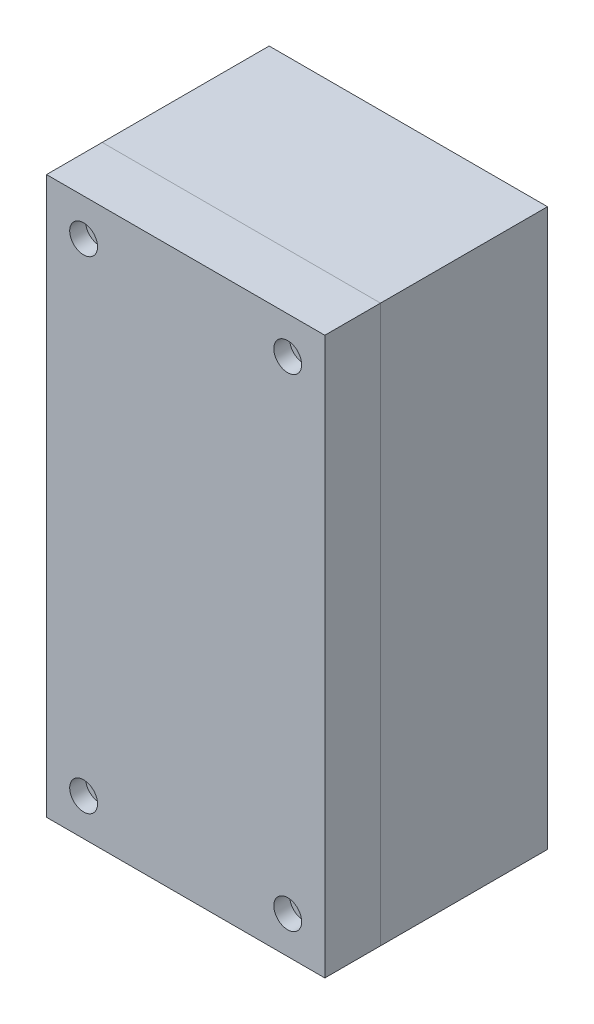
ISO-10303-21;
HEADER;
FILE_DESCRIPTION(('STEP AP214'),'2;1');
FILE_NAME('part.step','',(''),(''),'','','');
FILE_SCHEMA(('AUTOMOTIVE_DESIGN { 1 0 10303 214 1 1 1 1 }'));
ENDSEC;
DATA;
#1=APPLICATION_CONTEXT('core data for automotive mechanical design processes');
#2=APPLICATION_PROTOCOL_DEFINITION('international standard','automotive_design',2000,#1);
#3=PRODUCT_CONTEXT('',#1,'mechanical');
#4=PRODUCT('Part','Part','',(#3));
#5=PRODUCT_RELATED_PRODUCT_CATEGORY('part','',(#4));
#6=PRODUCT_DEFINITION_FORMATION('','',#4);
#7=PRODUCT_DEFINITION_CONTEXT('part definition',#1,'design');
#8=PRODUCT_DEFINITION('design','',#6,#7);
#9=PRODUCT_DEFINITION_SHAPE('','',#8);
#10=(LENGTH_UNIT() NAMED_UNIT(*) SI_UNIT(.MILLI.,.METRE.));
#11=(NAMED_UNIT(*) PLANE_ANGLE_UNIT() SI_UNIT($,.RADIAN.));
#12=(NAMED_UNIT(*) SI_UNIT($,.STERADIAN.) SOLID_ANGLE_UNIT());
#13=UNCERTAINTY_MEASURE_WITH_UNIT(LENGTH_MEASURE(1.E-05),#10,'distance_accuracy_value','');
#14=(GEOMETRIC_REPRESENTATION_CONTEXT(3) GLOBAL_UNCERTAINTY_ASSIGNED_CONTEXT((#13)) GLOBAL_UNIT_ASSIGNED_CONTEXT((#10,
#11,#12)) REPRESENTATION_CONTEXT('',''));
#15=CARTESIAN_POINT('',(0.,0.,0.));
#16=DIRECTION('',(0.,0.,1.));
#17=DIRECTION('',(1.,0.,0.));
#18=AXIS2_PLACEMENT_3D('',#15,#16,#17);
#19=CARTESIAN_POINT('',(-71.0000000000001,146.,110.));
#20=DIRECTION('',(-1.,0.,0.));
#21=DIRECTION('',(0.,-1.,0.));
#22=AXIS2_PLACEMENT_3D('',#19,#20,#21);
#23=PLANE('',#22);
#24=DIRECTION('',(0.,0.,-1.));
#25=VECTOR('',#24,1.);
#26=CARTESIAN_POINT('',(-71.0000000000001,-146.,110.));
#27=LINE('',#26,#25);
#28=CARTESIAN_POINT('',(-71.0000000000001,-146.,90.));
#29=VERTEX_POINT('',#28);
#30=CARTESIAN_POINT('',(-71.0000000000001,-146.,0.));
#31=VERTEX_POINT('',#30);
#32=EDGE_CURVE('P0_E102',#29,#31,#27,.T.);
#33=ORIENTED_EDGE('',*,*,#32,.T.);
#34=DIRECTION('',(0.,1.,0.));
#35=VECTOR('',#34,1.);
#36=CARTESIAN_POINT('',(-71.0000000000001,-150.,0.));
#37=LINE('',#36,#35);
#38=CARTESIAN_POINT('',(-71.0000000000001,146.,0.));
#39=VERTEX_POINT('',#38);
#40=EDGE_CURVE('P0_E116',#31,#39,#37,.T.);
#41=ORIENTED_EDGE('',*,*,#40,.T.);
#42=DIRECTION('',(0.,0.,1.));
#43=VECTOR('',#42,1.);
#44=CARTESIAN_POINT('',(-71.0000000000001,146.,110.));
#45=LINE('',#44,#43);
#46=CARTESIAN_POINT('',(-71.0000000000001,146.,90.));
#47=VERTEX_POINT('',#46);
#48=EDGE_CURVE('P0_E19',#39,#47,#45,.T.);
#49=ORIENTED_EDGE('',*,*,#48,.T.);
#50=DIRECTION('',(0.,1.,0.));
#51=VECTOR('',#50,1.);
#52=CARTESIAN_POINT('',(-71.0000000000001,-150.,90.));
#53=LINE('',#52,#51);
#54=EDGE_CURVE('P0_E106',#29,#47,#53,.T.);
#55=ORIENTED_EDGE('',*,*,#54,.F.);
#56=EDGE_LOOP('',(#33,#41,#49,#55));
#57=FACE_BOUND('',#56,.T.);
#58=ADVANCED_FACE('P0_F16',(#57),#23,.F.);
#59=CARTESIAN_POINT('',(71.0000000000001,146.,110.));
#60=DIRECTION('',(0.,1.,0.));
#61=DIRECTION('',(0.,0.,1.));
#62=AXIS2_PLACEMENT_3D('',#59,#60,#61);
#63=PLANE('',#62);
#64=ORIENTED_EDGE('',*,*,#48,.F.);
#65=DIRECTION('',(1.,0.,0.));
#66=VECTOR('',#65,1.);
#67=CARTESIAN_POINT('',(-75.,146.,0.));
#68=LINE('',#67,#66);
#69=CARTESIAN_POINT('',(71.0000000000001,146.,0.));
#70=VERTEX_POINT('',#69);
#71=EDGE_CURVE('P0_E130',#39,#70,#68,.T.);
#72=ORIENTED_EDGE('',*,*,#71,.T.);
#73=DIRECTION('',(0.,0.,1.));
#74=VECTOR('',#73,1.);
#75=CARTESIAN_POINT('',(71.0000000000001,146.,110.));
#76=LINE('',#75,#74);
#77=CARTESIAN_POINT('',(71.0000000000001,146.,90.));
#78=VERTEX_POINT('',#77);
#79=EDGE_CURVE('P0_E78',#70,#78,#76,.T.);
#80=ORIENTED_EDGE('',*,*,#79,.T.);
#81=DIRECTION('',(1.,0.,0.));
#82=VECTOR('',#81,1.);
#83=CARTESIAN_POINT('',(-75.,146.,90.));
#84=LINE('',#83,#82);
#85=EDGE_CURVE('P0_E90',#47,#78,#84,.T.);
#86=ORIENTED_EDGE('',*,*,#85,.F.);
#87=EDGE_LOOP('',(#64,#72,#80,#86));
#88=FACE_BOUND('',#87,.T.);
#89=ADVANCED_FACE('P0_F118',(#88),#63,.F.);
#90=CARTESIAN_POINT('',(71.0000000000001,146.,110.));
#91=DIRECTION('',(1.,0.,0.));
#92=DIRECTION('',(0.,1.,0.));
#93=AXIS2_PLACEMENT_3D('',#90,#91,#92);
#94=PLANE('',#93);
#95=ORIENTED_EDGE('',*,*,#79,.F.);
#96=DIRECTION('',(0.,1.,0.));
#97=VECTOR('',#96,1.);
#98=CARTESIAN_POINT('',(71.0000000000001,-150.,0.));
#99=LINE('',#98,#97);
#100=CARTESIAN_POINT('',(71.0000000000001,-146.,0.));
#101=VERTEX_POINT('',#100);
#102=EDGE_CURVE('P0_E98',#70,#101,#99,.F.);
#103=ORIENTED_EDGE('',*,*,#102,.T.);
#104=DIRECTION('',(0.,0.,-1.));
#105=VECTOR('',#104,1.);
#106=CARTESIAN_POINT('',(71.,-146.,110.));
#107=LINE('',#106,#105);
#108=CARTESIAN_POINT('',(71.0000000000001,-146.,90.));
#109=VERTEX_POINT('',#108);
#110=EDGE_CURVE('P0_E95',#101,#109,#107,.F.);
#111=ORIENTED_EDGE('',*,*,#110,.T.);
#112=DIRECTION('',(0.,1.,0.));
#113=VECTOR('',#112,1.);
#114=CARTESIAN_POINT('',(71.0000000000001,-150.,90.));
#115=LINE('',#114,#113);
#116=EDGE_CURVE('P0_E84',#78,#109,#115,.F.);
#117=ORIENTED_EDGE('',*,*,#116,.F.);
#118=EDGE_LOOP('',(#95,#103,#111,#117));
#119=FACE_BOUND('',#118,.T.);
#120=ADVANCED_FACE('P0_F96',(#119),#94,.F.);
#121=CARTESIAN_POINT('',(71.,-146.,110.));
#122=DIRECTION('',(0.,-1.,0.));
#123=DIRECTION('',(0.,0.,-1.));
#124=AXIS2_PLACEMENT_3D('',#121,#122,#123);
#125=PLANE('',#124);
#126=ORIENTED_EDGE('',*,*,#110,.F.);
#127=DIRECTION('',(1.,0.,0.));
#128=VECTOR('',#127,1.);
#129=CARTESIAN_POINT('',(-75.,-146.,0.));
#130=LINE('',#129,#128);
#131=EDGE_CURVE('P0_E133',#101,#31,#130,.F.);
#132=ORIENTED_EDGE('',*,*,#131,.T.);
#133=ORIENTED_EDGE('',*,*,#32,.F.);
#134=DIRECTION('',(1.,0.,0.));
#135=VECTOR('',#134,1.);
#136=CARTESIAN_POINT('',(-75.,-146.,90.));
#137=LINE('',#136,#135);
#138=EDGE_CURVE('P0_E88',#109,#29,#137,.F.);
#139=ORIENTED_EDGE('',*,*,#138,.F.);
#140=EDGE_LOOP('',(#126,#132,#133,#139));
#141=FACE_BOUND('',#140,.T.);
#142=ADVANCED_FACE('P0_F104',(#141),#125,.F.);
#143=CARTESIAN_POINT('',(74.9999999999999,150.,90.));
#144=DIRECTION('',(-1.,0.,0.));
#145=DIRECTION('',(0.,-1.,0.));
#146=AXIS2_PLACEMENT_3D('',#143,#144,#145);
#147=PLANE('',#146);
#148=DIRECTION('',(0.,0.,-1.));
#149=VECTOR('',#148,1.);
#150=CARTESIAN_POINT('',(74.9999999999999,150.,90.));
#151=LINE('',#150,#149);
#152=CARTESIAN_POINT('',(75.,150.,0.));
#153=VERTEX_POINT('',#152);
#154=CARTESIAN_POINT('',(75.,150.,90.));
#155=VERTEX_POINT('',#154);
#156=EDGE_CURVE('P0_E92',#153,#155,#151,.F.);
#157=ORIENTED_EDGE('',*,*,#156,.T.);
#158=DIRECTION('',(0.,1.,0.));
#159=VECTOR('',#158,1.);
#160=CARTESIAN_POINT('',(75.,-150.,90.));
#161=LINE('',#160,#159);
#162=CARTESIAN_POINT('',(75.,-150.,90.));
#163=VERTEX_POINT('',#162);
#164=EDGE_CURVE('P0_E119',#163,#155,#161,.T.);
#165=ORIENTED_EDGE('',*,*,#164,.F.);
#166=DIRECTION('',(0.,0.,1.));
#167=VECTOR('',#166,1.);
#168=CARTESIAN_POINT('',(75.,-150.,90.));
#169=LINE('',#168,#167);
#170=CARTESIAN_POINT('',(75.,-150.,0.));
#171=VERTEX_POINT('',#170);
#172=EDGE_CURVE('P0_E127',#163,#171,#169,.F.);
#173=ORIENTED_EDGE('',*,*,#172,.T.);
#174=DIRECTION('',(0.,1.,0.));
#175=VECTOR('',#174,1.);
#176=CARTESIAN_POINT('',(75.,-150.,0.));
#177=LINE('',#176,#175);
#178=EDGE_CURVE('P0_E136',#171,#153,#177,.T.);
#179=ORIENTED_EDGE('',*,*,#178,.T.);
#180=EDGE_LOOP('',(#157,#165,#173,#179));
#181=FACE_BOUND('',#180,.T.);
#182=ADVANCED_FACE('P0_F177',(#181),#147,.F.);
#183=CARTESIAN_POINT('',(-75.0000000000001,150.,90.));
#184=DIRECTION('',(0.,-1.,0.));
#185=DIRECTION('',(0.,0.,-1.));
#186=AXIS2_PLACEMENT_3D('',#183,#184,#185);
#187=PLANE('',#186);
#188=DIRECTION('',(0.,0.,1.));
#189=VECTOR('',#188,1.);
#190=CARTESIAN_POINT('',(-75.0000000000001,150.,90.));
#191=LINE('',#190,#189);
#192=CARTESIAN_POINT('',(-75.0000000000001,150.,0.));
#193=VERTEX_POINT('',#192);
#194=CARTESIAN_POINT('',(-75.0000000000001,150.,90.));
#195=VERTEX_POINT('',#194);
#196=EDGE_CURVE('P0_E142',#193,#195,#191,.T.);
#197=ORIENTED_EDGE('',*,*,#196,.T.);
#198=DIRECTION('',(1.,0.,0.));
#199=VECTOR('',#198,1.);
#200=CARTESIAN_POINT('',(-75.,150.,90.));
#201=LINE('',#200,#199);
#202=EDGE_CURVE('P0_E120',#155,#195,#201,.F.);
#203=ORIENTED_EDGE('',*,*,#202,.F.);
#204=ORIENTED_EDGE('',*,*,#156,.F.);
#205=DIRECTION('',(1.,0.,0.));
#206=VECTOR('',#205,1.);
#207=CARTESIAN_POINT('',(-75.,150.,0.));
#208=LINE('',#207,#206);
#209=EDGE_CURVE('P0_E139',#153,#193,#208,.F.);
#210=ORIENTED_EDGE('',*,*,#209,.T.);
#211=EDGE_LOOP('',(#197,#203,#204,#210));
#212=FACE_BOUND('',#211,.T.);
#213=ADVANCED_FACE('P0_F159',(#212),#187,.F.);
#214=CARTESIAN_POINT('',(-75.,-150.,90.));
#215=DIRECTION('',(0.,0.,1.));
#216=DIRECTION('',(1.,0.,0.));
#217=AXIS2_PLACEMENT_3D('',#214,#215,#216);
#218=PLANE('',#217);
#219=ORIENTED_EDGE('',*,*,#164,.T.);
#220=ORIENTED_EDGE('',*,*,#202,.T.);
#221=DIRECTION('',(0.,1.,0.));
#222=VECTOR('',#221,1.);
#223=CARTESIAN_POINT('',(-75.0000000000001,150.,90.));
#224=LINE('',#223,#222);
#225=CARTESIAN_POINT('',(-75.,-150.,90.));
#226=VERTEX_POINT('',#225);
#227=EDGE_CURVE('P0_E145',#195,#226,#224,.F.);
#228=ORIENTED_EDGE('',*,*,#227,.T.);
#229=DIRECTION('',(1.,0.,0.));
#230=VECTOR('',#229,1.);
#231=CARTESIAN_POINT('',(-75.,-150.,90.));
#232=LINE('',#231,#230);
#233=EDGE_CURVE('P0_E124',#226,#163,#232,.T.);
#234=ORIENTED_EDGE('',*,*,#233,.T.);
#235=EDGE_LOOP('',(#219,#220,#228,#234));
#236=FACE_BOUND('',#235,.T.);
#237=ORIENTED_EDGE('',*,*,#54,.T.);
#238=ORIENTED_EDGE('',*,*,#85,.T.);
#239=ORIENTED_EDGE('',*,*,#116,.T.);
#240=ORIENTED_EDGE('',*,*,#138,.T.);
#241=EDGE_LOOP('',(#237,#238,#239,#240));
#242=FACE_BOUND('',#241,.T.);
#243=ADVANCED_FACE('P0_F86',(#236,#242),#218,.T.);
#244=CARTESIAN_POINT('',(-75.,-150.,90.));
#245=DIRECTION('',(0.,1.,0.));
#246=DIRECTION('',(0.,0.,1.));
#247=AXIS2_PLACEMENT_3D('',#244,#245,#246);
#248=PLANE('',#247);
#249=ORIENTED_EDGE('',*,*,#172,.F.);
#250=ORIENTED_EDGE('',*,*,#233,.F.);
#251=DIRECTION('',(0.,0.,1.));
#252=VECTOR('',#251,1.);
#253=CARTESIAN_POINT('',(-75.,-150.,90.));
#254=LINE('',#253,#252);
#255=CARTESIAN_POINT('',(-75.,-150.,0.));
#256=VERTEX_POINT('',#255);
#257=EDGE_CURVE('P0_E25',#226,#256,#254,.F.);
#258=ORIENTED_EDGE('',*,*,#257,.T.);
#259=DIRECTION('',(1.,0.,0.));
#260=VECTOR('',#259,1.);
#261=CARTESIAN_POINT('',(-75.,-150.,0.));
#262=LINE('',#261,#260);
#263=EDGE_CURVE('P0_E33',#256,#171,#262,.T.);
#264=ORIENTED_EDGE('',*,*,#263,.T.);
#265=EDGE_LOOP('',(#249,#250,#258,#264));
#266=FACE_BOUND('',#265,.T.);
#267=ADVANCED_FACE('P0_F152',(#266),#248,.F.);
#268=CARTESIAN_POINT('',(-75.,-150.,0.));
#269=DIRECTION('',(0.,0.,1.));
#270=DIRECTION('',(1.,0.,0.));
#271=AXIS2_PLACEMENT_3D('',#268,#269,#270);
#272=PLANE('',#271);
#273=ORIENTED_EDGE('',*,*,#209,.F.);
#274=ORIENTED_EDGE('',*,*,#178,.F.);
#275=ORIENTED_EDGE('',*,*,#263,.F.);
#276=DIRECTION('',(0.,1.,0.));
#277=VECTOR('',#276,1.);
#278=CARTESIAN_POINT('',(-75.0000000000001,150.,0.));
#279=LINE('',#278,#277);
#280=EDGE_CURVE('P0_E11',#256,#193,#279,.T.);
#281=ORIENTED_EDGE('',*,*,#280,.T.);
#282=EDGE_LOOP('',(#273,#274,#275,#281));
#283=FACE_BOUND('',#282,.T.);
#284=ORIENTED_EDGE('',*,*,#102,.F.);
#285=ORIENTED_EDGE('',*,*,#71,.F.);
#286=ORIENTED_EDGE('',*,*,#40,.F.);
#287=ORIENTED_EDGE('',*,*,#131,.F.);
#288=EDGE_LOOP('',(#284,#285,#286,#287));
#289=FACE_BOUND('',#288,.T.);
#290=ADVANCED_FACE('P0_F161',(#283,#289),#272,.F.);
#291=CARTESIAN_POINT('',(-75.0000000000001,150.,90.));
#292=DIRECTION('',(1.,0.,0.));
#293=DIRECTION('',(0.,1.,0.));
#294=AXIS2_PLACEMENT_3D('',#291,#292,#293);
#295=PLANE('',#294);
#296=ORIENTED_EDGE('',*,*,#257,.F.);
#297=ORIENTED_EDGE('',*,*,#227,.F.);
#298=ORIENTED_EDGE('',*,*,#196,.F.);
#299=ORIENTED_EDGE('',*,*,#280,.F.);
#300=EDGE_LOOP('',(#296,#297,#298,#299));
#301=FACE_BOUND('',#300,.T.);
#302=ADVANCED_FACE('P0_F155',(#301),#295,.F.);
#303=CLOSED_SHELL('',(#58,#89,#120,#142,#182,#213,#243,#267,#290,#302));
#304=MANIFOLD_SOLID_BREP('P0_B1',#303);
#305=CARTESIAN_POINT('',(71.,-146.,110.));
#306=DIRECTION('',(0.,0.,-1.));
#307=DIRECTION('',(-1.,0.,0.));
#308=AXIS2_PLACEMENT_3D('',#305,#306,#307);
#309=PLANE('',#308);
#310=CARTESIAN_POINT('',(55.,-130.,110.));
#311=DIRECTION('',(0.,0.,1.));
#312=DIRECTION('',(1.,0.,0.));
#313=AXIS2_PLACEMENT_3D('',#310,#311,#312);
#314=CIRCLE('',#313,4.49999999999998);
#315=CARTESIAN_POINT('',(59.5,-130.,110.));
#316=VERTEX_POINT('',#315);
#317=EDGE_CURVE('P1_E89',#316,#316,#314,.T.);
#318=ORIENTED_EDGE('',*,*,#317,.T.);
#319=EDGE_LOOP('',(#318));
#320=FACE_BOUND('',#319,.T.);
#321=CARTESIAN_POINT('',(-54.9999999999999,130.,110.));
#322=DIRECTION('',(0.,0.,1.));
#323=DIRECTION('',(1.,0.,0.));
#324=AXIS2_PLACEMENT_3D('',#321,#322,#323);
#325=CIRCLE('',#324,4.49999999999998);
#326=CARTESIAN_POINT('',(-50.4999999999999,130.,110.));
#327=VERTEX_POINT('',#326);
#328=EDGE_CURVE('P1_E152',#327,#327,#325,.T.);
#329=ORIENTED_EDGE('',*,*,#328,.T.);
#330=EDGE_LOOP('',(#329));
#331=FACE_BOUND('',#330,.T.);
#332=DIRECTION('',(0.,-1.,0.));
#333=VECTOR('',#332,1.);
#334=CARTESIAN_POINT('',(-71.0000000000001,146.,110.));
#335=LINE('',#334,#333);
#336=CARTESIAN_POINT('',(-71.0000000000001,-146.,110.));
#337=VERTEX_POINT('',#336);
#338=CARTESIAN_POINT('',(-71.0000000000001,146.,110.));
#339=VERTEX_POINT('',#338);
#340=EDGE_CURVE('P1_E81',#337,#339,#335,.F.);
#341=ORIENTED_EDGE('',*,*,#340,.T.);
#342=DIRECTION('',(1.,0.,0.));
#343=VECTOR('',#342,1.);
#344=CARTESIAN_POINT('',(71.0000000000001,146.,110.));
#345=LINE('',#344,#343);
#346=CARTESIAN_POINT('',(71.0000000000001,146.,110.));
#347=VERTEX_POINT('',#346);
#348=EDGE_CURVE('P1_E78',#339,#347,#345,.T.);
#349=ORIENTED_EDGE('',*,*,#348,.T.);
#350=DIRECTION('',(0.,1.,0.));
#351=VECTOR('',#350,1.);
#352=CARTESIAN_POINT('',(71.0000000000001,146.,110.));
#353=LINE('',#352,#351);
#354=CARTESIAN_POINT('',(71.0000000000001,-146.,110.));
#355=VERTEX_POINT('',#354);
#356=EDGE_CURVE('P1_E103',#347,#355,#353,.F.);
#357=ORIENTED_EDGE('',*,*,#356,.T.);
#358=DIRECTION('',(1.,0.,0.));
#359=VECTOR('',#358,1.);
#360=CARTESIAN_POINT('',(71.,-146.,110.));
#361=LINE('',#360,#359);
#362=EDGE_CURVE('P1_E85',#355,#337,#361,.F.);
#363=ORIENTED_EDGE('',*,*,#362,.T.);
#364=EDGE_LOOP('',(#341,#349,#357,#363));
#365=FACE_BOUND('',#364,.T.);
#366=CARTESIAN_POINT('',(55.,130.,110.));
#367=DIRECTION('',(0.,0.,1.));
#368=DIRECTION('',(1.,0.,0.));
#369=AXIS2_PLACEMENT_3D('',#366,#367,#368);
#370=CIRCLE('',#369,4.49999999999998);
#371=CARTESIAN_POINT('',(59.5,130.,110.));
#372=VERTEX_POINT('',#371);
#373=EDGE_CURVE('P1_E19',#372,#372,#370,.T.);
#374=ORIENTED_EDGE('',*,*,#373,.T.);
#375=EDGE_LOOP('',(#374));
#376=FACE_BOUND('',#375,.T.);
#377=CARTESIAN_POINT('',(-54.9999999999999,-130.,110.));
#378=DIRECTION('',(0.,0.,1.));
#379=DIRECTION('',(1.,0.,0.));
#380=AXIS2_PLACEMENT_3D('',#377,#378,#379);
#381=CIRCLE('',#380,4.49999999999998);
#382=CARTESIAN_POINT('',(-50.4999999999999,-130.,110.));
#383=VERTEX_POINT('',#382);
#384=EDGE_CURVE('P1_E150',#383,#383,#381,.T.);
#385=ORIENTED_EDGE('',*,*,#384,.T.);
#386=EDGE_LOOP('',(#385));
#387=FACE_BOUND('',#386,.T.);
#388=ADVANCED_FACE('P1_F16',(#320,#331,#365,#376,#387),#309,.T.);
#389=CARTESIAN_POINT('',(55.,130.,120.));
#390=DIRECTION('',(0.,0.,1.));
#391=DIRECTION('',(1.,0.,0.));
#392=AXIS2_PLACEMENT_3D('',#389,#390,#391);
#393=CYLINDRICAL_SURFACE('',#392,4.49999999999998);
#394=ORIENTED_EDGE('',*,*,#373,.F.);
#395=EDGE_LOOP('',(#394));
#396=FACE_BOUND('',#395,.T.);
#397=CARTESIAN_POINT('',(55.,130.,111.4));
#398=DIRECTION('',(0.,0.,1.));
#399=DIRECTION('',(1.,0.,0.));
#400=AXIS2_PLACEMENT_3D('',#397,#398,#399);
#401=CIRCLE('',#400,4.49999999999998);
#402=CARTESIAN_POINT('',(59.5,130.,111.4));
#403=VERTEX_POINT('',#402);
#404=EDGE_CURVE('P1_E144',#403,#403,#401,.T.);
#405=ORIENTED_EDGE('',*,*,#404,.T.);
#406=EDGE_LOOP('',(#405));
#407=FACE_BOUND('',#406,.T.);
#408=ADVANCED_FACE('P1_F160',(#396,#407),#393,.F.);
#409=CARTESIAN_POINT('',(-54.9999999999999,130.,120.));
#410=DIRECTION('',(0.,0.,1.));
#411=DIRECTION('',(1.,0.,0.));
#412=AXIS2_PLACEMENT_3D('',#409,#410,#411);
#413=CYLINDRICAL_SURFACE('',#412,4.49999999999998);
#414=ORIENTED_EDGE('',*,*,#328,.F.);
#415=EDGE_LOOP('',(#414));
#416=FACE_BOUND('',#415,.T.);
#417=CARTESIAN_POINT('',(-54.9999999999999,130.,111.4));
#418=DIRECTION('',(0.,0.,1.));
#419=DIRECTION('',(1.,0.,0.));
#420=AXIS2_PLACEMENT_3D('',#417,#418,#419);
#421=CIRCLE('',#420,4.49999999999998);
#422=CARTESIAN_POINT('',(-50.4999999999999,130.,111.4));
#423=VERTEX_POINT('',#422);
#424=EDGE_CURVE('P1_E141',#423,#423,#421,.T.);
#425=ORIENTED_EDGE('',*,*,#424,.T.);
#426=EDGE_LOOP('',(#425));
#427=FACE_BOUND('',#426,.T.);
#428=ADVANCED_FACE('P1_F163',(#416,#427),#413,.F.);
#429=CARTESIAN_POINT('',(-54.9999999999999,-130.,120.));
#430=DIRECTION('',(0.,0.,1.));
#431=DIRECTION('',(1.,0.,0.));
#432=AXIS2_PLACEMENT_3D('',#429,#430,#431);
#433=CYLINDRICAL_SURFACE('',#432,4.49999999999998);
#434=ORIENTED_EDGE('',*,*,#384,.F.);
#435=EDGE_LOOP('',(#434));
#436=FACE_BOUND('',#435,.T.);
#437=CARTESIAN_POINT('',(-54.9999999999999,-130.,111.4));
#438=DIRECTION('',(0.,0.,1.));
#439=DIRECTION('',(1.,0.,0.));
#440=AXIS2_PLACEMENT_3D('',#437,#438,#439);
#441=CIRCLE('',#440,4.49999999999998);
#442=CARTESIAN_POINT('',(-50.4999999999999,-130.,111.4));
#443=VERTEX_POINT('',#442);
#444=EDGE_CURVE('P1_E138',#443,#443,#441,.T.);
#445=ORIENTED_EDGE('',*,*,#444,.T.);
#446=EDGE_LOOP('',(#445));
#447=FACE_BOUND('',#446,.T.);
#448=ADVANCED_FACE('P1_F239',(#436,#447),#433,.F.);
#449=CARTESIAN_POINT('',(55.,-130.,120.));
#450=DIRECTION('',(0.,0.,1.));
#451=DIRECTION('',(1.,0.,0.));
#452=AXIS2_PLACEMENT_3D('',#449,#450,#451);
#453=CYLINDRICAL_SURFACE('',#452,4.49999999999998);
#454=ORIENTED_EDGE('',*,*,#317,.F.);
#455=EDGE_LOOP('',(#454));
#456=FACE_BOUND('',#455,.T.);
#457=CARTESIAN_POINT('',(55.,-130.,111.4));
#458=DIRECTION('',(0.,0.,1.));
#459=DIRECTION('',(1.,0.,0.));
#460=AXIS2_PLACEMENT_3D('',#457,#458,#459);
#461=CIRCLE('',#460,4.49999999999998);
#462=CARTESIAN_POINT('',(59.5,-130.,111.4));
#463=VERTEX_POINT('',#462);
#464=EDGE_CURVE('P1_E135',#463,#463,#461,.T.);
#465=ORIENTED_EDGE('',*,*,#464,.T.);
#466=EDGE_LOOP('',(#465));
#467=FACE_BOUND('',#466,.T.);
#468=ADVANCED_FACE('P1_F241',(#456,#467),#453,.F.);
#469=CARTESIAN_POINT('',(-71.0000000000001,146.,110.));
#470=DIRECTION('',(-1.,0.,0.));
#471=DIRECTION('',(0.,-1.,0.));
#472=AXIS2_PLACEMENT_3D('',#469,#470,#471);
#473=PLANE('',#472);
#474=ORIENTED_EDGE('',*,*,#340,.F.);
#475=DIRECTION('',(0.,0.,-1.));
#476=VECTOR('',#475,1.);
#477=CARTESIAN_POINT('',(-71.0000000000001,-146.,110.));
#478=LINE('',#477,#476);
#479=CARTESIAN_POINT('',(-71.0000000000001,-146.,90.));
#480=VERTEX_POINT('',#479);
#481=EDGE_CURVE('P1_E147',#337,#480,#478,.T.);
#482=ORIENTED_EDGE('',*,*,#481,.T.);
#483=DIRECTION('',(0.,1.,0.));
#484=VECTOR('',#483,1.);
#485=CARTESIAN_POINT('',(-71.0000000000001,-150.,90.));
#486=LINE('',#485,#484);
#487=CARTESIAN_POINT('',(-71.0000000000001,146.,90.));
#488=VERTEX_POINT('',#487);
#489=EDGE_CURVE('P1_E94',#480,#488,#486,.T.);
#490=ORIENTED_EDGE('',*,*,#489,.T.);
#491=DIRECTION('',(0.,0.,1.));
#492=VECTOR('',#491,1.);
#493=CARTESIAN_POINT('',(-71.0000000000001,146.,110.));
#494=LINE('',#493,#492);
#495=EDGE_CURVE('P1_E88',#488,#339,#494,.T.);
#496=ORIENTED_EDGE('',*,*,#495,.T.);
#497=EDGE_LOOP('',(#474,#482,#490,#496));
#498=FACE_BOUND('',#497,.T.);
#499=ADVANCED_FACE('P1_F92',(#498),#473,.F.);
#500=CARTESIAN_POINT('',(71.0000000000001,146.,110.));
#501=DIRECTION('',(0.,1.,0.));
#502=DIRECTION('',(0.,0.,1.));
#503=AXIS2_PLACEMENT_3D('',#500,#501,#502);
#504=PLANE('',#503);
#505=ORIENTED_EDGE('',*,*,#348,.F.);
#506=ORIENTED_EDGE('',*,*,#495,.F.);
#507=DIRECTION('',(1.,0.,0.));
#508=VECTOR('',#507,1.);
#509=CARTESIAN_POINT('',(-75.0000000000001,146.,90.));
#510=LINE('',#509,#508);
#511=CARTESIAN_POINT('',(71.0000000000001,146.,90.));
#512=VERTEX_POINT('',#511);
#513=EDGE_CURVE('P1_E271',#488,#512,#510,.T.);
#514=ORIENTED_EDGE('',*,*,#513,.T.);
#515=DIRECTION('',(0.,0.,1.));
#516=VECTOR('',#515,1.);
#517=CARTESIAN_POINT('',(71.0000000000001,146.,110.));
#518=LINE('',#517,#516);
#519=EDGE_CURVE('P1_E100',#512,#347,#518,.T.);
#520=ORIENTED_EDGE('',*,*,#519,.T.);
#521=EDGE_LOOP('',(#505,#506,#514,#520));
#522=FACE_BOUND('',#521,.T.);
#523=ADVANCED_FACE('P1_F98',(#522),#504,.F.);
#524=CARTESIAN_POINT('',(71.0000000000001,146.,110.));
#525=DIRECTION('',(1.,0.,0.));
#526=DIRECTION('',(0.,1.,0.));
#527=AXIS2_PLACEMENT_3D('',#524,#525,#526);
#528=PLANE('',#527);
#529=ORIENTED_EDGE('',*,*,#356,.F.);
#530=ORIENTED_EDGE('',*,*,#519,.F.);
#531=DIRECTION('',(0.,1.,0.));
#532=VECTOR('',#531,1.);
#533=CARTESIAN_POINT('',(71.0000000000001,-150.,90.));
#534=LINE('',#533,#532);
#535=CARTESIAN_POINT('',(71.0000000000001,-146.,90.));
#536=VERTEX_POINT('',#535);
#537=EDGE_CURVE('P1_E273',#512,#536,#534,.F.);
#538=ORIENTED_EDGE('',*,*,#537,.T.);
#539=DIRECTION('',(0.,0.,-1.));
#540=VECTOR('',#539,1.);
#541=CARTESIAN_POINT('',(71.,-146.,110.));
#542=LINE('',#541,#540);
#543=EDGE_CURVE('P1_E265',#536,#355,#542,.F.);
#544=ORIENTED_EDGE('',*,*,#543,.T.);
#545=EDGE_LOOP('',(#529,#530,#538,#544));
#546=FACE_BOUND('',#545,.T.);
#547=ADVANCED_FACE('P1_F180',(#546),#528,.F.);
#548=CARTESIAN_POINT('',(71.,-146.,110.));
#549=DIRECTION('',(0.,-1.,0.));
#550=DIRECTION('',(0.,0.,-1.));
#551=AXIS2_PLACEMENT_3D('',#548,#549,#550);
#552=PLANE('',#551);
#553=ORIENTED_EDGE('',*,*,#362,.F.);
#554=ORIENTED_EDGE('',*,*,#543,.F.);
#555=DIRECTION('',(1.,0.,0.));
#556=VECTOR('',#555,1.);
#557=CARTESIAN_POINT('',(-75.0000000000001,-146.,90.));
#558=LINE('',#557,#556);
#559=EDGE_CURVE('P1_E134',#536,#480,#558,.F.);
#560=ORIENTED_EDGE('',*,*,#559,.T.);
#561=ORIENTED_EDGE('',*,*,#481,.F.);
#562=EDGE_LOOP('',(#553,#554,#560,#561));
#563=FACE_BOUND('',#562,.T.);
#564=ADVANCED_FACE('P1_F169',(#563),#552,.F.);
#565=CARTESIAN_POINT('',(59.5,130.,111.4));
#566=DIRECTION('',(0.,0.,-1.));
#567=DIRECTION('',(-1.,0.,0.));
#568=AXIS2_PLACEMENT_3D('',#565,#566,#567);
#569=PLANE('',#568);
#570=CARTESIAN_POINT('',(55.,130.,111.4));
#571=DIRECTION('',(0.,0.,1.));
#572=DIRECTION('',(1.,0.,0.));
#573=AXIS2_PLACEMENT_3D('',#570,#571,#572);
#574=CIRCLE('',#573,7.5);
#575=CARTESIAN_POINT('',(62.5,130.,111.4));
#576=VERTEX_POINT('',#575);
#577=EDGE_CURVE('P1_E131',#576,#576,#574,.T.);
#578=ORIENTED_EDGE('',*,*,#577,.T.);
#579=EDGE_LOOP('',(#578));
#580=FACE_BOUND('',#579,.T.);
#581=ORIENTED_EDGE('',*,*,#404,.F.);
#582=EDGE_LOOP('',(#581));
#583=FACE_BOUND('',#582,.T.);
#584=ADVANCED_FACE('P1_F166',(#580,#583),#569,.F.);
#585=CARTESIAN_POINT('',(-50.4999999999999,130.,111.4));
#586=DIRECTION('',(0.,0.,-1.));
#587=DIRECTION('',(-1.,0.,0.));
#588=AXIS2_PLACEMENT_3D('',#585,#586,#587);
#589=PLANE('',#588);
#590=CARTESIAN_POINT('',(-54.9999999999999,130.,111.4));
#591=DIRECTION('',(0.,0.,1.));
#592=DIRECTION('',(1.,0.,0.));
#593=AXIS2_PLACEMENT_3D('',#590,#591,#592);
#594=CIRCLE('',#593,7.5);
#595=CARTESIAN_POINT('',(-47.4999999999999,130.,111.4));
#596=VERTEX_POINT('',#595);
#597=EDGE_CURVE('P1_E128',#596,#596,#594,.T.);
#598=ORIENTED_EDGE('',*,*,#597,.T.);
#599=EDGE_LOOP('',(#598));
#600=FACE_BOUND('',#599,.T.);
#601=ORIENTED_EDGE('',*,*,#424,.F.);
#602=EDGE_LOOP('',(#601));
#603=FACE_BOUND('',#602,.T.);
#604=ADVANCED_FACE('P1_F168',(#600,#603),#589,.F.);
#605=CARTESIAN_POINT('',(-50.4999999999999,-130.,111.4));
#606=DIRECTION('',(0.,0.,-1.));
#607=DIRECTION('',(-1.,0.,0.));
#608=AXIS2_PLACEMENT_3D('',#605,#606,#607);
#609=PLANE('',#608);
#610=CARTESIAN_POINT('',(-54.9999999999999,-130.,111.4));
#611=DIRECTION('',(0.,0.,1.));
#612=DIRECTION('',(1.,0.,0.));
#613=AXIS2_PLACEMENT_3D('',#610,#611,#612);
#614=CIRCLE('',#613,7.5);
#615=CARTESIAN_POINT('',(-47.4999999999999,-130.,111.4));
#616=VERTEX_POINT('',#615);
#617=EDGE_CURVE('P1_E125',#616,#616,#614,.T.);
#618=ORIENTED_EDGE('',*,*,#617,.T.);
#619=EDGE_LOOP('',(#618));
#620=FACE_BOUND('',#619,.T.);
#621=ORIENTED_EDGE('',*,*,#444,.F.);
#622=EDGE_LOOP('',(#621));
#623=FACE_BOUND('',#622,.T.);
#624=ADVANCED_FACE('P1_F177',(#620,#623),#609,.F.);
#625=CARTESIAN_POINT('',(59.5,-130.,111.4));
#626=DIRECTION('',(0.,0.,-1.));
#627=DIRECTION('',(-1.,0.,0.));
#628=AXIS2_PLACEMENT_3D('',#625,#626,#627);
#629=PLANE('',#628);
#630=CARTESIAN_POINT('',(55.,-130.,111.4));
#631=DIRECTION('',(0.,0.,1.));
#632=DIRECTION('',(1.,0.,0.));
#633=AXIS2_PLACEMENT_3D('',#630,#631,#632);
#634=CIRCLE('',#633,7.5);
#635=CARTESIAN_POINT('',(62.5,-130.,111.4));
#636=VERTEX_POINT('',#635);
#637=EDGE_CURVE('P1_E121',#636,#636,#634,.T.);
#638=ORIENTED_EDGE('',*,*,#637,.T.);
#639=EDGE_LOOP('',(#638));
#640=FACE_BOUND('',#639,.T.);
#641=ORIENTED_EDGE('',*,*,#464,.F.);
#642=EDGE_LOOP('',(#641));
#643=FACE_BOUND('',#642,.T.);
#644=ADVANCED_FACE('P1_F226',(#640,#643),#629,.F.);
#645=CARTESIAN_POINT('',(-75.0000000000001,-150.,90.));
#646=DIRECTION('',(0.,0.,1.));
#647=DIRECTION('',(1.,0.,0.));
#648=AXIS2_PLACEMENT_3D('',#645,#646,#647);
#649=PLANE('',#648);
#650=DIRECTION('',(1.,0.,0.));
#651=VECTOR('',#650,1.);
#652=CARTESIAN_POINT('',(-75.0000000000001,150.,90.));
#653=LINE('',#652,#651);
#654=CARTESIAN_POINT('',(-75.0000000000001,150.,90.));
#655=VERTEX_POINT('',#654);
#656=CARTESIAN_POINT('',(75.,150.,90.));
#657=VERTEX_POINT('',#656);
#658=EDGE_CURVE('P1_E120',#655,#657,#653,.T.);
#659=ORIENTED_EDGE('',*,*,#658,.T.);
#660=DIRECTION('',(0.,-1.,0.));
#661=VECTOR('',#660,1.);
#662=CARTESIAN_POINT('',(75.,150.,90.));
#663=LINE('',#662,#661);
#664=CARTESIAN_POINT('',(75.,-150.,90.));
#665=VERTEX_POINT('',#664);
#666=EDGE_CURVE('P1_E285',#657,#665,#663,.T.);
#667=ORIENTED_EDGE('',*,*,#666,.T.);
#668=DIRECTION('',(-1.,0.,0.));
#669=VECTOR('',#668,1.);
#670=CARTESIAN_POINT('',(-75.0000000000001,-150.,90.));
#671=LINE('',#670,#669);
#672=CARTESIAN_POINT('',(-75.0000000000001,-150.,90.));
#673=VERTEX_POINT('',#672);
#674=EDGE_CURVE('P1_E280',#665,#673,#671,.T.);
#675=ORIENTED_EDGE('',*,*,#674,.T.);
#676=DIRECTION('',(0.,1.,0.));
#677=VECTOR('',#676,1.);
#678=CARTESIAN_POINT('',(-75.0000000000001,150.,90.));
#679=LINE('',#678,#677);
#680=EDGE_CURVE('P1_E124',#673,#655,#679,.T.);
#681=ORIENTED_EDGE('',*,*,#680,.T.);
#682=EDGE_LOOP('',(#659,#667,#675,#681));
#683=FACE_BOUND('',#682,.T.);
#684=ORIENTED_EDGE('',*,*,#537,.F.);
#685=ORIENTED_EDGE('',*,*,#513,.F.);
#686=ORIENTED_EDGE('',*,*,#489,.F.);
#687=ORIENTED_EDGE('',*,*,#559,.F.);
#688=EDGE_LOOP('',(#684,#685,#686,#687));
#689=FACE_BOUND('',#688,.T.);
#690=ADVANCED_FACE('P1_F222',(#683,#689),#649,.F.);
#691=CARTESIAN_POINT('',(55.,130.,120.));
#692=DIRECTION('',(0.,0.,1.));
#693=DIRECTION('',(1.,0.,0.));
#694=AXIS2_PLACEMENT_3D('',#691,#692,#693);
#695=CYLINDRICAL_SURFACE('',#694,7.5);
#696=CARTESIAN_POINT('',(55.,130.,120.));
#697=DIRECTION('',(0.,0.,1.));
#698=DIRECTION('',(1.,0.,0.));
#699=AXIS2_PLACEMENT_3D('',#696,#697,#698);
#700=CIRCLE('',#699,7.5);
#701=CARTESIAN_POINT('',(62.5,130.,120.));
#702=VERTEX_POINT('',#701);
#703=EDGE_CURVE('P1_E117',#702,#702,#700,.F.);
#704=ORIENTED_EDGE('',*,*,#703,.F.);
#705=EDGE_LOOP('',(#704));
#706=FACE_BOUND('',#705,.T.);
#707=ORIENTED_EDGE('',*,*,#577,.F.);
#708=EDGE_LOOP('',(#707));
#709=FACE_BOUND('',#708,.T.);
#710=ADVANCED_FACE('P1_F218',(#706,#709),#695,.F.);
#711=CARTESIAN_POINT('',(-54.9999999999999,130.,120.));
#712=DIRECTION('',(0.,0.,1.));
#713=DIRECTION('',(1.,0.,0.));
#714=AXIS2_PLACEMENT_3D('',#711,#712,#713);
#715=CYLINDRICAL_SURFACE('',#714,7.5);
#716=CARTESIAN_POINT('',(-54.9999999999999,130.,120.));
#717=DIRECTION('',(0.,0.,1.));
#718=DIRECTION('',(1.,0.,0.));
#719=AXIS2_PLACEMENT_3D('',#716,#717,#718);
#720=CIRCLE('',#719,7.5);
#721=CARTESIAN_POINT('',(-47.4999999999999,130.,120.));
#722=VERTEX_POINT('',#721);
#723=EDGE_CURVE('P1_E114',#722,#722,#720,.F.);
#724=ORIENTED_EDGE('',*,*,#723,.F.);
#725=EDGE_LOOP('',(#724));
#726=FACE_BOUND('',#725,.T.);
#727=ORIENTED_EDGE('',*,*,#597,.F.);
#728=EDGE_LOOP('',(#727));
#729=FACE_BOUND('',#728,.T.);
#730=ADVANCED_FACE('P1_F214',(#726,#729),#715,.F.);
#731=CARTESIAN_POINT('',(-54.9999999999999,-130.,120.));
#732=DIRECTION('',(0.,0.,1.));
#733=DIRECTION('',(1.,0.,0.));
#734=AXIS2_PLACEMENT_3D('',#731,#732,#733);
#735=CYLINDRICAL_SURFACE('',#734,7.5);
#736=CARTESIAN_POINT('',(-54.9999999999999,-130.,120.));
#737=DIRECTION('',(0.,0.,1.));
#738=DIRECTION('',(1.,0.,0.));
#739=AXIS2_PLACEMENT_3D('',#736,#737,#738);
#740=CIRCLE('',#739,7.5);
#741=CARTESIAN_POINT('',(-47.4999999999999,-130.,120.));
#742=VERTEX_POINT('',#741);
#743=EDGE_CURVE('P1_E111',#742,#742,#740,.F.);
#744=ORIENTED_EDGE('',*,*,#743,.F.);
#745=EDGE_LOOP('',(#744));
#746=FACE_BOUND('',#745,.T.);
#747=ORIENTED_EDGE('',*,*,#617,.F.);
#748=EDGE_LOOP('',(#747));
#749=FACE_BOUND('',#748,.T.);
#750=ADVANCED_FACE('P1_F210',(#746,#749),#735,.F.);
#751=CARTESIAN_POINT('',(55.,-130.,120.));
#752=DIRECTION('',(0.,0.,1.));
#753=DIRECTION('',(1.,0.,0.));
#754=AXIS2_PLACEMENT_3D('',#751,#752,#753);
#755=CYLINDRICAL_SURFACE('',#754,7.5);
#756=CARTESIAN_POINT('',(55.,-130.,120.));
#757=DIRECTION('',(0.,0.,1.));
#758=DIRECTION('',(1.,0.,0.));
#759=AXIS2_PLACEMENT_3D('',#756,#757,#758);
#760=CIRCLE('',#759,7.5);
#761=CARTESIAN_POINT('',(62.5,-130.,120.));
#762=VERTEX_POINT('',#761);
#763=EDGE_CURVE('P1_E107',#762,#762,#760,.F.);
#764=ORIENTED_EDGE('',*,*,#763,.F.);
#765=EDGE_LOOP('',(#764));
#766=FACE_BOUND('',#765,.T.);
#767=ORIENTED_EDGE('',*,*,#637,.F.);
#768=EDGE_LOOP('',(#767));
#769=FACE_BOUND('',#768,.T.);
#770=ADVANCED_FACE('P1_F206',(#766,#769),#755,.F.);
#771=CARTESIAN_POINT('',(-75.0000000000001,150.,120.));
#772=DIRECTION('',(1.,0.,0.));
#773=DIRECTION('',(0.,1.,0.));
#774=AXIS2_PLACEMENT_3D('',#771,#772,#773);
#775=PLANE('',#774);
#776=DIRECTION('',(0.,0.,1.));
#777=VECTOR('',#776,1.);
#778=CARTESIAN_POINT('',(-75.0000000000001,-150.,120.));
#779=LINE('',#778,#777);
#780=CARTESIAN_POINT('',(-75.0000000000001,-150.,120.));
#781=VERTEX_POINT('',#780);
#782=EDGE_CURVE('P1_E278',#673,#781,#779,.T.);
#783=ORIENTED_EDGE('',*,*,#782,.T.);
#784=DIRECTION('',(0.,1.,0.));
#785=VECTOR('',#784,1.);
#786=CARTESIAN_POINT('',(-75.0000000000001,-150.,120.));
#787=LINE('',#786,#785);
#788=CARTESIAN_POINT('',(-75.0000000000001,150.,120.));
#789=VERTEX_POINT('',#788);
#790=EDGE_CURVE('P1_E110',#789,#781,#787,.F.);
#791=ORIENTED_EDGE('',*,*,#790,.F.);
#792=DIRECTION('',(0.,0.,1.));
#793=VECTOR('',#792,1.);
#794=CARTESIAN_POINT('',(-75.0000000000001,150.,120.));
#795=LINE('',#794,#793);
#796=EDGE_CURVE('P1_E289',#789,#655,#795,.F.);
#797=ORIENTED_EDGE('',*,*,#796,.T.);
#798=ORIENTED_EDGE('',*,*,#680,.F.);
#799=EDGE_LOOP('',(#783,#791,#797,#798));
#800=FACE_BOUND('',#799,.T.);
#801=ADVANCED_FACE('P1_F202',(#800),#775,.F.);
#802=CARTESIAN_POINT('',(-75.0000000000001,-150.,120.));
#803=DIRECTION('',(0.,1.,0.));
#804=DIRECTION('',(-1.,0.,0.));
#805=AXIS2_PLACEMENT_3D('',#802,#803,#804);
#806=PLANE('',#805);
#807=DIRECTION('',(0.,0.,1.));
#808=VECTOR('',#807,1.);
#809=CARTESIAN_POINT('',(75.,-150.,120.));
#810=LINE('',#809,#808);
#811=CARTESIAN_POINT('',(75.,-150.,120.));
#812=VERTEX_POINT('',#811);
#813=EDGE_CURVE('P1_E283',#665,#812,#810,.T.);
#814=ORIENTED_EDGE('',*,*,#813,.T.);
#815=DIRECTION('',(1.,0.,0.));
#816=VECTOR('',#815,1.);
#817=CARTESIAN_POINT('',(-75.0000000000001,-150.,120.));
#818=LINE('',#817,#816);
#819=EDGE_CURVE('P1_E296',#781,#812,#818,.T.);
#820=ORIENTED_EDGE('',*,*,#819,.F.);
#821=ORIENTED_EDGE('',*,*,#782,.F.);
#822=ORIENTED_EDGE('',*,*,#674,.F.);
#823=EDGE_LOOP('',(#814,#820,#821,#822));
#824=FACE_BOUND('',#823,.T.);
#825=ADVANCED_FACE('P1_F199',(#824),#806,.F.);
#826=CARTESIAN_POINT('',(75.,150.,120.));
#827=DIRECTION('',(-1.,0.,0.));
#828=DIRECTION('',(0.,-1.,0.));
#829=AXIS2_PLACEMENT_3D('',#826,#827,#828);
#830=PLANE('',#829);
#831=DIRECTION('',(0.,0.,1.));
#832=VECTOR('',#831,1.);
#833=CARTESIAN_POINT('',(75.,150.,120.));
#834=LINE('',#833,#832);
#835=CARTESIAN_POINT('',(75.,150.,120.));
#836=VERTEX_POINT('',#835);
#837=EDGE_CURVE('P1_E34',#657,#836,#834,.T.);
#838=ORIENTED_EDGE('',*,*,#837,.T.);
#839=DIRECTION('',(0.,1.,0.));
#840=VECTOR('',#839,1.);
#841=CARTESIAN_POINT('',(75.,-150.,120.));
#842=LINE('',#841,#840);
#843=EDGE_CURVE('P1_E25',#812,#836,#842,.T.);
#844=ORIENTED_EDGE('',*,*,#843,.F.);
#845=ORIENTED_EDGE('',*,*,#813,.F.);
#846=ORIENTED_EDGE('',*,*,#666,.F.);
#847=EDGE_LOOP('',(#838,#844,#845,#846));
#848=FACE_BOUND('',#847,.T.);
#849=ADVANCED_FACE('P1_F191',(#848),#830,.F.);
#850=CARTESIAN_POINT('',(-75.0000000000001,150.,120.));
#851=DIRECTION('',(0.,-1.,0.));
#852=DIRECTION('',(1.,0.,0.));
#853=AXIS2_PLACEMENT_3D('',#850,#851,#852);
#854=PLANE('',#853);
#855=ORIENTED_EDGE('',*,*,#796,.F.);
#856=DIRECTION('',(1.,0.,0.));
#857=VECTOR('',#856,1.);
#858=CARTESIAN_POINT('',(-75.0000000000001,150.,120.));
#859=LINE('',#858,#857);
#860=EDGE_CURVE('P1_E11',#836,#789,#859,.F.);
#861=ORIENTED_EDGE('',*,*,#860,.F.);
#862=ORIENTED_EDGE('',*,*,#837,.F.);
#863=ORIENTED_EDGE('',*,*,#658,.F.);
#864=EDGE_LOOP('',(#855,#861,#862,#863));
#865=FACE_BOUND('',#864,.T.);
#866=ADVANCED_FACE('P1_F185',(#865),#854,.F.);
#867=CARTESIAN_POINT('',(-75.0000000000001,-150.,120.));
#868=DIRECTION('',(0.,0.,1.));
#869=DIRECTION('',(1.,0.,0.));
#870=AXIS2_PLACEMENT_3D('',#867,#868,#869);
#871=PLANE('',#870);
#872=ORIENTED_EDGE('',*,*,#843,.T.);
#873=ORIENTED_EDGE('',*,*,#860,.T.);
#874=ORIENTED_EDGE('',*,*,#790,.T.);
#875=ORIENTED_EDGE('',*,*,#819,.T.);
#876=EDGE_LOOP('',(#872,#873,#874,#875));
#877=FACE_BOUND('',#876,.T.);
#878=ORIENTED_EDGE('',*,*,#763,.T.);
#879=EDGE_LOOP('',(#878));
#880=FACE_BOUND('',#879,.T.);
#881=ORIENTED_EDGE('',*,*,#743,.T.);
#882=EDGE_LOOP('',(#881));
#883=FACE_BOUND('',#882,.T.);
#884=ORIENTED_EDGE('',*,*,#723,.T.);
#885=EDGE_LOOP('',(#884));
#886=FACE_BOUND('',#885,.T.);
#887=ORIENTED_EDGE('',*,*,#703,.T.);
#888=EDGE_LOOP('',(#887));
#889=FACE_BOUND('',#888,.T.);
#890=ADVANCED_FACE('P1_F183',(#877,#880,#883,#886,#889),#871,.T.);
#891=CLOSED_SHELL('',(#388,#408,#428,#448,#468,#499,#523,#547,#564,#584,#604,#624,#644,#690,
#710,#730,#750,#770,#801,#825,#849,#866,#890));
#892=MANIFOLD_SOLID_BREP('P1_B1',#891);
#893=ADVANCED_BREP_SHAPE_REPRESENTATION('',(#18,#304,#892),#14);
#894=SHAPE_DEFINITION_REPRESENTATION(#9,#893);
ENDSEC;
END-ISO-10303-21;
